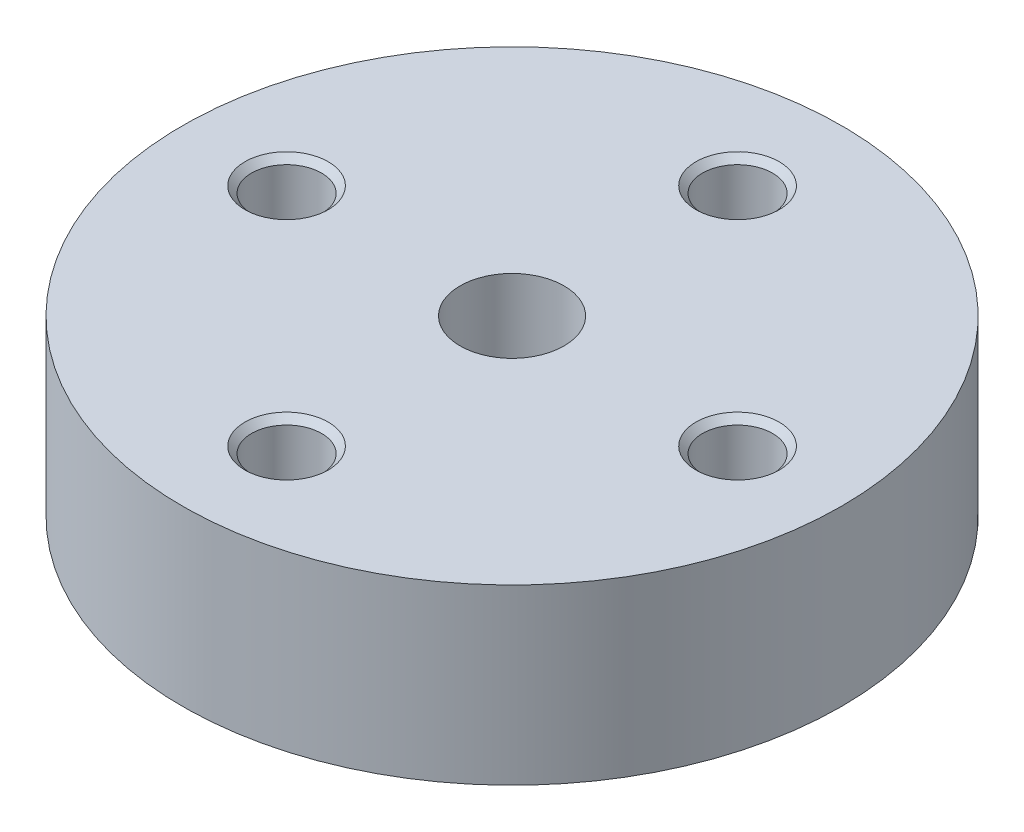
ISO-10303-21;
HEADER;
FILE_DESCRIPTION(('STEP AP214'),'2;1');
FILE_NAME('part.step','',(''),(''),'','','');
FILE_SCHEMA(('AUTOMOTIVE_DESIGN { 1 0 10303 214 1 1 1 1 }'));
ENDSEC;
DATA;
#1=APPLICATION_CONTEXT('core data for automotive mechanical design processes');
#2=APPLICATION_PROTOCOL_DEFINITION('international standard','automotive_design',2000,#1);
#3=PRODUCT_CONTEXT('',#1,'mechanical');
#4=PRODUCT('Part','Part','',(#3));
#5=PRODUCT_RELATED_PRODUCT_CATEGORY('part','',(#4));
#6=PRODUCT_DEFINITION_FORMATION('','',#4);
#7=PRODUCT_DEFINITION_CONTEXT('part definition',#1,'design');
#8=PRODUCT_DEFINITION('design','',#6,#7);
#9=PRODUCT_DEFINITION_SHAPE('','',#8);
#10=(LENGTH_UNIT() NAMED_UNIT(*) SI_UNIT(.MILLI.,.METRE.));
#11=(NAMED_UNIT(*) PLANE_ANGLE_UNIT() SI_UNIT($,.RADIAN.));
#12=(NAMED_UNIT(*) SI_UNIT($,.STERADIAN.) SOLID_ANGLE_UNIT());
#13=UNCERTAINTY_MEASURE_WITH_UNIT(LENGTH_MEASURE(1.E-05),#10,'distance_accuracy_value','');
#14=(GEOMETRIC_REPRESENTATION_CONTEXT(3) GLOBAL_UNCERTAINTY_ASSIGNED_CONTEXT((#13)) GLOBAL_UNIT_ASSIGNED_CONTEXT((#10,
#11,#12)) REPRESENTATION_CONTEXT('',''));
#15=CARTESIAN_POINT('',(0.,0.,0.));
#16=DIRECTION('',(0.,0.,1.));
#17=DIRECTION('',(1.,0.,0.));
#18=AXIS2_PLACEMENT_3D('',#15,#16,#17);
#19=CARTESIAN_POINT('',(0.,12.5,0.));
#20=DIRECTION('',(0.,-1.,0.));
#21=DIRECTION('',(1.,0.,0.));
#22=AXIS2_PLACEMENT_3D('',#19,#20,#21);
#23=CYLINDRICAL_SURFACE('',#22,47.5);
#24=CARTESIAN_POINT('',(0.,0.,0.));
#25=DIRECTION('',(0.,1.,0.));
#26=DIRECTION('',(1.,0.,0.));
#27=AXIS2_PLACEMENT_3D('',#24,#25,#26);
#28=CIRCLE('',#27,47.5);
#29=CARTESIAN_POINT('',(47.5,0.,0.));
#30=VERTEX_POINT('',#29);
#31=EDGE_CURVE('E9',#30,#30,#28,.T.);
#32=ORIENTED_EDGE('',*,*,#31,.T.);
#33=EDGE_LOOP('',(#32));
#34=FACE_BOUND('',#33,.T.);
#35=CARTESIAN_POINT('',(0.,25.,0.));
#36=DIRECTION('',(0.,1.,0.));
#37=DIRECTION('',(1.,0.,0.));
#38=AXIS2_PLACEMENT_3D('',#35,#36,#37);
#39=CIRCLE('',#38,47.5);
#40=CARTESIAN_POINT('',(47.5,25.,0.));
#41=VERTEX_POINT('',#40);
#42=EDGE_CURVE('E145',#41,#41,#39,.T.);
#43=ORIENTED_EDGE('',*,*,#42,.F.);
#44=EDGE_LOOP('',(#43));
#45=FACE_BOUND('',#44,.T.);
#46=ADVANCED_FACE('F15',(#34,#45),#23,.T.);
#47=CARTESIAN_POINT('',(27.5,0.,0.));
#48=DIRECTION('',(0.,-1.,0.));
#49=DIRECTION('',(-1.,0.,0.));
#50=AXIS2_PLACEMENT_3D('',#47,#48,#49);
#51=PLANE('',#50);
#52=CARTESIAN_POINT('',(0.,0.,0.));
#53=DIRECTION('',(0.,1.,0.));
#54=DIRECTION('',(1.,0.,0.));
#55=AXIS2_PLACEMENT_3D('',#52,#53,#54);
#56=CIRCLE('',#55,7.5);
#57=CARTESIAN_POINT('',(7.5,0.,0.));
#58=VERTEX_POINT('',#57);
#59=EDGE_CURVE('E22',#58,#58,#56,.T.);
#60=ORIENTED_EDGE('',*,*,#59,.T.);
#61=EDGE_LOOP('',(#60));
#62=FACE_BOUND('',#61,.T.);
#63=ORIENTED_EDGE('',*,*,#31,.F.);
#64=EDGE_LOOP('',(#63));
#65=FACE_BOUND('',#64,.T.);
#66=ADVANCED_FACE('F139',(#62,#65),#51,.T.);
#67=CARTESIAN_POINT('',(0.,12.5,0.));
#68=DIRECTION('',(0.,-1.,0.));
#69=DIRECTION('',(1.,0.,0.));
#70=AXIS2_PLACEMENT_3D('',#67,#68,#69);
#71=CYLINDRICAL_SURFACE('',#70,7.5);
#72=CARTESIAN_POINT('',(0.,25.,0.));
#73=DIRECTION('',(0.,1.,0.));
#74=DIRECTION('',(1.,0.,0.));
#75=AXIS2_PLACEMENT_3D('',#72,#73,#74);
#76=CIRCLE('',#75,7.5);
#77=CARTESIAN_POINT('',(7.5,25.,0.));
#78=VERTEX_POINT('',#77);
#79=EDGE_CURVE('E146',#78,#78,#76,.T.);
#80=ORIENTED_EDGE('',*,*,#79,.T.);
#81=EDGE_LOOP('',(#80));
#82=FACE_BOUND('',#81,.T.);
#83=ORIENTED_EDGE('',*,*,#59,.F.);
#84=EDGE_LOOP('',(#83));
#85=FACE_BOUND('',#84,.T.);
#86=ADVANCED_FACE('F134',(#82,#85),#71,.F.);
#87=CARTESIAN_POINT('',(27.5,25.,0.));
#88=DIRECTION('',(0.,1.,0.));
#89=DIRECTION('',(1.,0.,0.));
#90=AXIS2_PLACEMENT_3D('',#87,#88,#89);
#91=PLANE('',#90);
#92=ORIENTED_EDGE('',*,*,#42,.T.);
#93=EDGE_LOOP('',(#92));
#94=FACE_BOUND('',#93,.T.);
#95=ORIENTED_EDGE('',*,*,#79,.F.);
#96=EDGE_LOOP('',(#95));
#97=FACE_BOUND('',#96,.T.);
#98=CARTESIAN_POINT('',(32.5,25.,0.));
#99=DIRECTION('',(0.,-1.,0.));
#100=DIRECTION('',(1.,0.,0.));
#101=AXIS2_PLACEMENT_3D('',#98,#99,#100);
#102=CIRCLE('',#101,6.);
#103=CARTESIAN_POINT('',(38.5,25.,0.));
#104=VERTEX_POINT('',#103);
#105=EDGE_CURVE('E158',#104,#104,#102,.T.);
#106=ORIENTED_EDGE('',*,*,#105,.T.);
#107=EDGE_LOOP('',(#106));
#108=FACE_BOUND('',#107,.T.);
#109=CARTESIAN_POINT('',(0.,25.,-32.5));
#110=DIRECTION('',(0.,-1.,0.));
#111=DIRECTION('',(0.,0.,-1.));
#112=AXIS2_PLACEMENT_3D('',#109,#110,#111);
#113=CIRCLE('',#112,6.);
#114=CARTESIAN_POINT('',(0.,25.,-38.5));
#115=VERTEX_POINT('',#114);
#116=EDGE_CURVE('E168',#115,#115,#113,.T.);
#117=ORIENTED_EDGE('',*,*,#116,.T.);
#118=EDGE_LOOP('',(#117));
#119=FACE_BOUND('',#118,.T.);
#120=CARTESIAN_POINT('',(-32.5,25.,0.));
#121=DIRECTION('',(0.,-1.,0.));
#122=DIRECTION('',(-1.,0.,0.));
#123=AXIS2_PLACEMENT_3D('',#120,#121,#122);
#124=CIRCLE('',#123,6.);
#125=CARTESIAN_POINT('',(-38.5,25.,0.));
#126=VERTEX_POINT('',#125);
#127=EDGE_CURVE('E175',#126,#126,#124,.T.);
#128=ORIENTED_EDGE('',*,*,#127,.T.);
#129=EDGE_LOOP('',(#128));
#130=FACE_BOUND('',#129,.T.);
#131=CARTESIAN_POINT('',(0.,25.,32.5));
#132=DIRECTION('',(0.,-1.,0.));
#133=DIRECTION('',(0.,0.,1.));
#134=AXIS2_PLACEMENT_3D('',#131,#132,#133);
#135=CIRCLE('',#134,6.);
#136=CARTESIAN_POINT('',(0.,25.,38.5));
#137=VERTEX_POINT('',#136);
#138=EDGE_CURVE('E187',#137,#137,#135,.T.);
#139=ORIENTED_EDGE('',*,*,#138,.T.);
#140=EDGE_LOOP('',(#139));
#141=FACE_BOUND('',#140,.T.);
#142=ADVANCED_FACE('F123',(#94,#97,#108,#119,#130,#141),#91,.T.);
#143=CARTESIAN_POINT('',(32.5,5.54137867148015,0.));
#144=DIRECTION('',(0.,1.,0.));
#145=DIRECTION('',(1.,0.,0.));
#146=AXIS2_PLACEMENT_3D('',#143,#144,#145);
#147=CONICAL_SURFACE('',#146,2.52640625,1.0471975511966);
#148=CARTESIAN_POINT('',(32.5,7.,0.));
#149=DIRECTION('',(0.,-1.,0.));
#150=DIRECTION('',(1.,0.,0.));
#151=AXIS2_PLACEMENT_3D('',#148,#149,#150);
#152=CIRCLE('',#151,5.0528125);
#153=CARTESIAN_POINT('',(37.5528125,7.,0.));
#154=VERTEX_POINT('',#153);
#155=EDGE_CURVE('E148',#154,#154,#152,.T.);
#156=ORIENTED_EDGE('',*,*,#155,.F.);
#157=EDGE_LOOP('',(#156));
#158=FACE_BOUND('',#157,.T.);
#159=CARTESIAN_POINT('',(32.5,4.08275734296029,0.));
#160=VERTEX_POINT('',#159);
#161=VERTEX_LOOP('',#160);
#162=FACE_BOUND('',#161,.T.);
#163=ADVANCED_FACE('F120',(#158,#162),#147,.F.);
#164=CARTESIAN_POINT('',(32.5,9.52640625,0.));
#165=DIRECTION('',(0.,1.,0.));
#166=DIRECTION('',(1.,0.,0.));
#167=AXIS2_PLACEMENT_3D('',#164,#165,#166);
#168=CYLINDRICAL_SURFACE('',#167,5.0528125);
#169=CARTESIAN_POINT('',(32.5,12.0528125,0.));
#170=DIRECTION('',(0.,-1.,0.));
#171=DIRECTION('',(1.,0.,0.));
#172=AXIS2_PLACEMENT_3D('',#169,#170,#171);
#173=CIRCLE('',#172,5.0528125);
#174=CARTESIAN_POINT('',(37.5528125,12.0528125,0.));
#175=VERTEX_POINT('',#174);
#176=EDGE_CURVE('E152',#175,#175,#173,.T.);
#177=ORIENTED_EDGE('',*,*,#176,.F.);
#178=EDGE_LOOP('',(#177));
#179=FACE_BOUND('',#178,.T.);
#180=ORIENTED_EDGE('',*,*,#155,.T.);
#181=EDGE_LOOP('',(#180));
#182=FACE_BOUND('',#181,.T.);
#183=ADVANCED_FACE('F122',(#179,#182),#168,.F.);
#184=CARTESIAN_POINT('',(32.5,12.52640625,0.));
#185=DIRECTION('',(0.,1.,0.));
#186=DIRECTION('',(1.,0.,0.));
#187=AXIS2_PLACEMENT_3D('',#184,#185,#186);
#188=CONICAL_SURFACE('',#187,5.52640625,0.785398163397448);
#189=CARTESIAN_POINT('',(32.5,13.,0.));
#190=DIRECTION('',(0.,-1.,0.));
#191=DIRECTION('',(1.,0.,0.));
#192=AXIS2_PLACEMENT_3D('',#189,#190,#191);
#193=CIRCLE('',#192,6.);
#194=CARTESIAN_POINT('',(38.5,13.,0.));
#195=VERTEX_POINT('',#194);
#196=EDGE_CURVE('E154',#195,#195,#193,.T.);
#197=ORIENTED_EDGE('',*,*,#196,.F.);
#198=EDGE_LOOP('',(#197));
#199=FACE_BOUND('',#198,.T.);
#200=ORIENTED_EDGE('',*,*,#176,.T.);
#201=EDGE_LOOP('',(#200));
#202=FACE_BOUND('',#201,.T.);
#203=ADVANCED_FACE('F131',(#199,#202),#188,.F.);
#204=CARTESIAN_POINT('',(38.02640625,13.,0.));
#205=DIRECTION('',(0.,1.,0.));
#206=DIRECTION('',(-1.,0.,0.));
#207=AXIS2_PLACEMENT_3D('',#204,#205,#206);
#208=PLANE('',#207);
#209=CARTESIAN_POINT('',(32.5,13.,0.));
#210=DIRECTION('',(0.,-1.,0.));
#211=DIRECTION('',(1.,0.,0.));
#212=AXIS2_PLACEMENT_3D('',#209,#210,#211);
#213=CIRCLE('',#212,5.0528125);
#214=CARTESIAN_POINT('',(37.5528125,13.,0.));
#215=VERTEX_POINT('',#214);
#216=EDGE_CURVE('E156',#215,#215,#213,.T.);
#217=ORIENTED_EDGE('',*,*,#216,.F.);
#218=EDGE_LOOP('',(#217));
#219=FACE_BOUND('',#218,.T.);
#220=ORIENTED_EDGE('',*,*,#196,.T.);
#221=EDGE_LOOP('',(#220));
#222=FACE_BOUND('',#221,.T.);
#223=ADVANCED_FACE('F281',(#219,#222),#208,.F.);
#224=CARTESIAN_POINT('',(32.5,18.52640625,0.));
#225=DIRECTION('',(0.,1.,0.));
#226=DIRECTION('',(1.,0.,0.));
#227=AXIS2_PLACEMENT_3D('',#224,#225,#226);
#228=CYLINDRICAL_SURFACE('',#227,5.0528125);
#229=CARTESIAN_POINT('',(32.5,24.0528125,0.));
#230=DIRECTION('',(0.,-1.,0.));
#231=DIRECTION('',(1.,0.,0.));
#232=AXIS2_PLACEMENT_3D('',#229,#230,#231);
#233=CIRCLE('',#232,5.0528125);
#234=CARTESIAN_POINT('',(37.5528125,24.0528125,0.));
#235=VERTEX_POINT('',#234);
#236=EDGE_CURVE('E159',#235,#235,#233,.T.);
#237=ORIENTED_EDGE('',*,*,#236,.F.);
#238=EDGE_LOOP('',(#237));
#239=FACE_BOUND('',#238,.T.);
#240=ORIENTED_EDGE('',*,*,#216,.T.);
#241=EDGE_LOOP('',(#240));
#242=FACE_BOUND('',#241,.T.);
#243=ADVANCED_FACE('F277',(#239,#242),#228,.F.);
#244=CARTESIAN_POINT('',(32.5,24.52640625,0.));
#245=DIRECTION('',(0.,1.,0.));
#246=DIRECTION('',(1.,0.,0.));
#247=AXIS2_PLACEMENT_3D('',#244,#245,#246);
#248=CONICAL_SURFACE('',#247,5.52640625,0.785398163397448);
#249=ORIENTED_EDGE('',*,*,#105,.F.);
#250=EDGE_LOOP('',(#249));
#251=FACE_BOUND('',#250,.T.);
#252=ORIENTED_EDGE('',*,*,#236,.T.);
#253=EDGE_LOOP('',(#252));
#254=FACE_BOUND('',#253,.T.);
#255=ADVANCED_FACE('F273',(#251,#254),#248,.F.);
#256=CARTESIAN_POINT('',(0.,5.54137867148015,-32.5));
#257=DIRECTION('',(0.,1.,0.));
#258=DIRECTION('',(0.,0.,-1.));
#259=AXIS2_PLACEMENT_3D('',#256,#257,#258);
#260=CONICAL_SURFACE('',#259,2.52640625,1.0471975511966);
#261=CARTESIAN_POINT('',(0.,7.,-32.5));
#262=DIRECTION('',(0.,-1.,0.));
#263=DIRECTION('',(0.,0.,-1.));
#264=AXIS2_PLACEMENT_3D('',#261,#262,#263);
#265=CIRCLE('',#264,5.0528125);
#266=CARTESIAN_POINT('',(0.,7.,-37.5528125));
#267=VERTEX_POINT('',#266);
#268=EDGE_CURVE('E161',#267,#267,#265,.T.);
#269=ORIENTED_EDGE('',*,*,#268,.F.);
#270=EDGE_LOOP('',(#269));
#271=FACE_BOUND('',#270,.T.);
#272=CARTESIAN_POINT('',(0.,4.08275734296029,-32.5));
#273=VERTEX_POINT('',#272);
#274=VERTEX_LOOP('',#273);
#275=FACE_BOUND('',#274,.T.);
#276=ADVANCED_FACE('F269',(#271,#275),#260,.F.);
#277=CARTESIAN_POINT('',(0.,9.52640625,-32.5));
#278=DIRECTION('',(0.,1.,0.));
#279=DIRECTION('',(0.,0.,-1.));
#280=AXIS2_PLACEMENT_3D('',#277,#278,#279);
#281=CYLINDRICAL_SURFACE('',#280,5.0528125);
#282=CARTESIAN_POINT('',(0.,12.0528125,-32.5));
#283=DIRECTION('',(0.,-1.,0.));
#284=DIRECTION('',(0.,0.,-1.));
#285=AXIS2_PLACEMENT_3D('',#282,#283,#284);
#286=CIRCLE('',#285,5.0528125);
#287=CARTESIAN_POINT('',(0.,12.0528125,-37.5528125));
#288=VERTEX_POINT('',#287);
#289=EDGE_CURVE('E163',#288,#288,#286,.T.);
#290=ORIENTED_EDGE('',*,*,#289,.F.);
#291=EDGE_LOOP('',(#290));
#292=FACE_BOUND('',#291,.T.);
#293=ORIENTED_EDGE('',*,*,#268,.T.);
#294=EDGE_LOOP('',(#293));
#295=FACE_BOUND('',#294,.T.);
#296=ADVANCED_FACE('F266',(#292,#295),#281,.F.);
#297=CARTESIAN_POINT('',(0.,12.52640625,-32.5));
#298=DIRECTION('',(0.,1.,0.));
#299=DIRECTION('',(0.,0.,-1.));
#300=AXIS2_PLACEMENT_3D('',#297,#298,#299);
#301=CONICAL_SURFACE('',#300,5.52640625,0.785398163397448);
#302=CARTESIAN_POINT('',(0.,13.,-32.5));
#303=DIRECTION('',(0.,-1.,0.));
#304=DIRECTION('',(0.,0.,-1.));
#305=AXIS2_PLACEMENT_3D('',#302,#303,#304);
#306=CIRCLE('',#305,6.);
#307=CARTESIAN_POINT('',(0.,13.,-38.5));
#308=VERTEX_POINT('',#307);
#309=EDGE_CURVE('E165',#308,#308,#306,.T.);
#310=ORIENTED_EDGE('',*,*,#309,.F.);
#311=EDGE_LOOP('',(#310));
#312=FACE_BOUND('',#311,.T.);
#313=ORIENTED_EDGE('',*,*,#289,.T.);
#314=EDGE_LOOP('',(#313));
#315=FACE_BOUND('',#314,.T.);
#316=ADVANCED_FACE('F258',(#312,#315),#301,.F.);
#317=CARTESIAN_POINT('',(0.,13.,-38.02640625));
#318=DIRECTION('',(0.,1.,0.));
#319=DIRECTION('',(0.,0.,1.));
#320=AXIS2_PLACEMENT_3D('',#317,#318,#319);
#321=PLANE('',#320);
#322=CARTESIAN_POINT('',(0.,13.,-32.5));
#323=DIRECTION('',(0.,-1.,0.));
#324=DIRECTION('',(0.,0.,-1.));
#325=AXIS2_PLACEMENT_3D('',#322,#323,#324);
#326=CIRCLE('',#325,5.0528125);
#327=CARTESIAN_POINT('',(0.,13.,-37.5528125));
#328=VERTEX_POINT('',#327);
#329=EDGE_CURVE('E166',#328,#328,#326,.T.);
#330=ORIENTED_EDGE('',*,*,#329,.F.);
#331=EDGE_LOOP('',(#330));
#332=FACE_BOUND('',#331,.T.);
#333=ORIENTED_EDGE('',*,*,#309,.T.);
#334=EDGE_LOOP('',(#333));
#335=FACE_BOUND('',#334,.T.);
#336=ADVANCED_FACE('F255',(#332,#335),#321,.F.);
#337=CARTESIAN_POINT('',(0.,18.52640625,-32.5));
#338=DIRECTION('',(0.,1.,0.));
#339=DIRECTION('',(0.,0.,-1.));
#340=AXIS2_PLACEMENT_3D('',#337,#338,#339);
#341=CYLINDRICAL_SURFACE('',#340,5.0528125);
#342=CARTESIAN_POINT('',(0.,24.0528125,-32.5));
#343=DIRECTION('',(0.,-1.,0.));
#344=DIRECTION('',(0.,0.,-1.));
#345=AXIS2_PLACEMENT_3D('',#342,#343,#344);
#346=CIRCLE('',#345,5.0528125);
#347=CARTESIAN_POINT('',(0.,24.0528125,-37.5528125));
#348=VERTEX_POINT('',#347);
#349=EDGE_CURVE('E177',#348,#348,#346,.T.);
#350=ORIENTED_EDGE('',*,*,#349,.F.);
#351=EDGE_LOOP('',(#350));
#352=FACE_BOUND('',#351,.T.);
#353=ORIENTED_EDGE('',*,*,#329,.T.);
#354=EDGE_LOOP('',(#353));
#355=FACE_BOUND('',#354,.T.);
#356=ADVANCED_FACE('F240',(#352,#355),#341,.F.);
#357=CARTESIAN_POINT('',(0.,24.52640625,-32.5));
#358=DIRECTION('',(0.,1.,0.));
#359=DIRECTION('',(0.,0.,-1.));
#360=AXIS2_PLACEMENT_3D('',#357,#358,#359);
#361=CONICAL_SURFACE('',#360,5.52640625,0.785398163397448);
#362=ORIENTED_EDGE('',*,*,#116,.F.);
#363=EDGE_LOOP('',(#362));
#364=FACE_BOUND('',#363,.T.);
#365=ORIENTED_EDGE('',*,*,#349,.T.);
#366=EDGE_LOOP('',(#365));
#367=FACE_BOUND('',#366,.T.);
#368=ADVANCED_FACE('F235',(#364,#367),#361,.F.);
#369=CARTESIAN_POINT('',(-32.5,5.54137867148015,0.));
#370=DIRECTION('',(0.,1.,0.));
#371=DIRECTION('',(-1.,0.,0.));
#372=AXIS2_PLACEMENT_3D('',#369,#370,#371);
#373=CONICAL_SURFACE('',#372,2.52640625,1.0471975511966);
#374=CARTESIAN_POINT('',(-32.5,7.,0.));
#375=DIRECTION('',(0.,-1.,0.));
#376=DIRECTION('',(-1.,0.,0.));
#377=AXIS2_PLACEMENT_3D('',#374,#375,#376);
#378=CIRCLE('',#377,5.0528125);
#379=CARTESIAN_POINT('',(-37.5528125,7.,0.));
#380=VERTEX_POINT('',#379);
#381=EDGE_CURVE('E171',#380,#380,#378,.T.);
#382=ORIENTED_EDGE('',*,*,#381,.F.);
#383=EDGE_LOOP('',(#382));
#384=FACE_BOUND('',#383,.T.);
#385=CARTESIAN_POINT('',(-32.5,4.08275734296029,0.));
#386=VERTEX_POINT('',#385);
#387=VERTEX_LOOP('',#386);
#388=FACE_BOUND('',#387,.T.);
#389=ADVANCED_FACE('F229',(#384,#388),#373,.F.);
#390=CARTESIAN_POINT('',(-32.5,9.52640625,0.));
#391=DIRECTION('',(0.,1.,0.));
#392=DIRECTION('',(-1.,0.,0.));
#393=AXIS2_PLACEMENT_3D('',#390,#391,#392);
#394=CYLINDRICAL_SURFACE('',#393,5.0528125);
#395=CARTESIAN_POINT('',(-32.5,12.0528125,0.));
#396=DIRECTION('',(0.,-1.,0.));
#397=DIRECTION('',(-1.,0.,0.));
#398=AXIS2_PLACEMENT_3D('',#395,#396,#397);
#399=CIRCLE('',#398,5.0528125);
#400=CARTESIAN_POINT('',(-37.5528125,12.0528125,0.));
#401=VERTEX_POINT('',#400);
#402=EDGE_CURVE('E169',#401,#401,#399,.T.);
#403=ORIENTED_EDGE('',*,*,#402,.F.);
#404=EDGE_LOOP('',(#403));
#405=FACE_BOUND('',#404,.T.);
#406=ORIENTED_EDGE('',*,*,#381,.T.);
#407=EDGE_LOOP('',(#406));
#408=FACE_BOUND('',#407,.T.);
#409=ADVANCED_FACE('F223',(#405,#408),#394,.F.);
#410=CARTESIAN_POINT('',(-32.5,12.52640625,0.));
#411=DIRECTION('',(0.,1.,0.));
#412=DIRECTION('',(-1.,0.,0.));
#413=AXIS2_PLACEMENT_3D('',#410,#411,#412);
#414=CONICAL_SURFACE('',#413,5.52640625,0.785398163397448);
#415=CARTESIAN_POINT('',(-32.5,13.,0.));
#416=DIRECTION('',(0.,-1.,0.));
#417=DIRECTION('',(-1.,0.,0.));
#418=AXIS2_PLACEMENT_3D('',#415,#416,#417);
#419=CIRCLE('',#418,6.);
#420=CARTESIAN_POINT('',(-38.5,13.,0.));
#421=VERTEX_POINT('',#420);
#422=EDGE_CURVE('E172',#421,#421,#419,.T.);
#423=ORIENTED_EDGE('',*,*,#422,.F.);
#424=EDGE_LOOP('',(#423));
#425=FACE_BOUND('',#424,.T.);
#426=ORIENTED_EDGE('',*,*,#402,.T.);
#427=EDGE_LOOP('',(#426));
#428=FACE_BOUND('',#427,.T.);
#429=ADVANCED_FACE('F217',(#425,#428),#414,.F.);
#430=CARTESIAN_POINT('',(-38.02640625,13.,0.));
#431=DIRECTION('',(0.,1.,0.));
#432=DIRECTION('',(1.,0.,0.));
#433=AXIS2_PLACEMENT_3D('',#430,#431,#432);
#434=PLANE('',#433);
#435=CARTESIAN_POINT('',(-32.5,13.,0.));
#436=DIRECTION('',(0.,-1.,0.));
#437=DIRECTION('',(-1.,0.,0.));
#438=AXIS2_PLACEMENT_3D('',#435,#436,#437);
#439=CIRCLE('',#438,5.0528125);
#440=CARTESIAN_POINT('',(-37.5528125,13.,0.));
#441=VERTEX_POINT('',#440);
#442=EDGE_CURVE('E174',#441,#441,#439,.T.);
#443=ORIENTED_EDGE('',*,*,#442,.F.);
#444=EDGE_LOOP('',(#443));
#445=FACE_BOUND('',#444,.T.);
#446=ORIENTED_EDGE('',*,*,#422,.T.);
#447=EDGE_LOOP('',(#446));
#448=FACE_BOUND('',#447,.T.);
#449=ADVANCED_FACE('F211',(#445,#448),#434,.F.);
#450=CARTESIAN_POINT('',(-32.5,18.52640625,0.));
#451=DIRECTION('',(0.,1.,0.));
#452=DIRECTION('',(-1.,0.,0.));
#453=AXIS2_PLACEMENT_3D('',#450,#451,#452);
#454=CYLINDRICAL_SURFACE('',#453,5.0528125);
#455=CARTESIAN_POINT('',(-32.5,24.0528125,0.));
#456=DIRECTION('',(0.,-1.,0.));
#457=DIRECTION('',(-1.,0.,0.));
#458=AXIS2_PLACEMENT_3D('',#455,#456,#457);
#459=CIRCLE('',#458,5.0528125);
#460=CARTESIAN_POINT('',(-37.5528125,24.0528125,0.));
#461=VERTEX_POINT('',#460);
#462=EDGE_CURVE('E189',#461,#461,#459,.T.);
#463=ORIENTED_EDGE('',*,*,#462,.F.);
#464=EDGE_LOOP('',(#463));
#465=FACE_BOUND('',#464,.T.);
#466=ORIENTED_EDGE('',*,*,#442,.T.);
#467=EDGE_LOOP('',(#466));
#468=FACE_BOUND('',#467,.T.);
#469=ADVANCED_FACE('F205',(#465,#468),#454,.F.);
#470=CARTESIAN_POINT('',(-32.5,24.52640625,0.));
#471=DIRECTION('',(0.,1.,0.));
#472=DIRECTION('',(-1.,0.,0.));
#473=AXIS2_PLACEMENT_3D('',#470,#471,#472);
#474=CONICAL_SURFACE('',#473,5.52640625,0.785398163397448);
#475=ORIENTED_EDGE('',*,*,#127,.F.);
#476=EDGE_LOOP('',(#475));
#477=FACE_BOUND('',#476,.T.);
#478=ORIENTED_EDGE('',*,*,#462,.T.);
#479=EDGE_LOOP('',(#478));
#480=FACE_BOUND('',#479,.T.);
#481=ADVANCED_FACE('F201',(#477,#480),#474,.F.);
#482=CARTESIAN_POINT('',(0.,5.54137867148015,32.5));
#483=DIRECTION('',(0.,1.,0.));
#484=DIRECTION('',(0.,0.,1.));
#485=AXIS2_PLACEMENT_3D('',#482,#483,#484);
#486=CONICAL_SURFACE('',#485,2.52640625,1.0471975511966);
#487=CARTESIAN_POINT('',(0.,7.,32.5));
#488=DIRECTION('',(0.,-1.,0.));
#489=DIRECTION('',(0.,0.,1.));
#490=AXIS2_PLACEMENT_3D('',#487,#488,#489);
#491=CIRCLE('',#490,5.0528125);
#492=CARTESIAN_POINT('',(0.,7.,37.5528125));
#493=VERTEX_POINT('',#492);
#494=EDGE_CURVE('E181',#493,#493,#491,.T.);
#495=ORIENTED_EDGE('',*,*,#494,.F.);
#496=EDGE_LOOP('',(#495));
#497=FACE_BOUND('',#496,.T.);
#498=CARTESIAN_POINT('',(0.,4.08275734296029,32.5));
#499=VERTEX_POINT('',#498);
#500=VERTEX_LOOP('',#499);
#501=FACE_BOUND('',#500,.T.);
#502=ADVANCED_FACE('F204',(#497,#501),#486,.F.);
#503=CARTESIAN_POINT('',(0.,9.52640625,32.5));
#504=DIRECTION('',(0.,1.,0.));
#505=DIRECTION('',(0.,0.,1.));
#506=AXIS2_PLACEMENT_3D('',#503,#504,#505);
#507=CYLINDRICAL_SURFACE('',#506,5.0528125);
#508=CARTESIAN_POINT('',(0.,12.0528125,32.5));
#509=DIRECTION('',(0.,-1.,0.));
#510=DIRECTION('',(0.,0.,1.));
#511=AXIS2_PLACEMENT_3D('',#508,#509,#510);
#512=CIRCLE('',#511,5.0528125);
#513=CARTESIAN_POINT('',(0.,12.0528125,37.5528125));
#514=VERTEX_POINT('',#513);
#515=EDGE_CURVE('E179',#514,#514,#512,.T.);
#516=ORIENTED_EDGE('',*,*,#515,.F.);
#517=EDGE_LOOP('',(#516));
#518=FACE_BOUND('',#517,.T.);
#519=ORIENTED_EDGE('',*,*,#494,.T.);
#520=EDGE_LOOP('',(#519));
#521=FACE_BOUND('',#520,.T.);
#522=ADVANCED_FACE('F253',(#518,#521),#507,.F.);
#523=CARTESIAN_POINT('',(0.,12.52640625,32.5));
#524=DIRECTION('',(0.,1.,0.));
#525=DIRECTION('',(0.,0.,1.));
#526=AXIS2_PLACEMENT_3D('',#523,#524,#525);
#527=CONICAL_SURFACE('',#526,5.52640625,0.785398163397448);
#528=CARTESIAN_POINT('',(0.,13.,32.5));
#529=DIRECTION('',(0.,-1.,0.));
#530=DIRECTION('',(0.,0.,1.));
#531=AXIS2_PLACEMENT_3D('',#528,#529,#530);
#532=CIRCLE('',#531,6.);
#533=CARTESIAN_POINT('',(0.,13.,38.5));
#534=VERTEX_POINT('',#533);
#535=EDGE_CURVE('E182',#534,#534,#532,.T.);
#536=ORIENTED_EDGE('',*,*,#535,.F.);
#537=EDGE_LOOP('',(#536));
#538=FACE_BOUND('',#537,.T.);
#539=ORIENTED_EDGE('',*,*,#515,.T.);
#540=EDGE_LOOP('',(#539));
#541=FACE_BOUND('',#540,.T.);
#542=ADVANCED_FACE('F249',(#538,#541),#527,.F.);
#543=CARTESIAN_POINT('',(0.,13.,38.02640625));
#544=DIRECTION('',(0.,1.,0.));
#545=DIRECTION('',(0.,0.,-1.));
#546=AXIS2_PLACEMENT_3D('',#543,#544,#545);
#547=PLANE('',#546);
#548=CARTESIAN_POINT('',(0.,13.,32.5));
#549=DIRECTION('',(0.,-1.,0.));
#550=DIRECTION('',(0.,0.,1.));
#551=AXIS2_PLACEMENT_3D('',#548,#549,#550);
#552=CIRCLE('',#551,5.0528125);
#553=CARTESIAN_POINT('',(0.,13.,37.5528125));
#554=VERTEX_POINT('',#553);
#555=EDGE_CURVE('E185',#554,#554,#552,.T.);
#556=ORIENTED_EDGE('',*,*,#555,.F.);
#557=EDGE_LOOP('',(#556));
#558=FACE_BOUND('',#557,.T.);
#559=ORIENTED_EDGE('',*,*,#535,.T.);
#560=EDGE_LOOP('',(#559));
#561=FACE_BOUND('',#560,.T.);
#562=ADVANCED_FACE('F246',(#558,#561),#547,.F.);
#563=CARTESIAN_POINT('',(0.,18.52640625,32.5));
#564=DIRECTION('',(0.,1.,0.));
#565=DIRECTION('',(0.,0.,1.));
#566=AXIS2_PLACEMENT_3D('',#563,#564,#565);
#567=CYLINDRICAL_SURFACE('',#566,5.0528125);
#568=CARTESIAN_POINT('',(0.,24.0528125,32.5));
#569=DIRECTION('',(0.,-1.,0.));
#570=DIRECTION('',(0.,0.,1.));
#571=AXIS2_PLACEMENT_3D('',#568,#569,#570);
#572=CIRCLE('',#571,5.0528125);
#573=CARTESIAN_POINT('',(0.,24.0528125,37.5528125));
#574=VERTEX_POINT('',#573);
#575=EDGE_CURVE('E194',#574,#574,#572,.T.);
#576=ORIENTED_EDGE('',*,*,#575,.F.);
#577=EDGE_LOOP('',(#576));
#578=FACE_BOUND('',#577,.T.);
#579=ORIENTED_EDGE('',*,*,#555,.T.);
#580=EDGE_LOOP('',(#579));
#581=FACE_BOUND('',#580,.T.);
#582=ADVANCED_FACE('F245',(#578,#581),#567,.F.);
#583=CARTESIAN_POINT('',(0.,24.52640625,32.5));
#584=DIRECTION('',(0.,1.,0.));
#585=DIRECTION('',(0.,0.,1.));
#586=AXIS2_PLACEMENT_3D('',#583,#584,#585);
#587=CONICAL_SURFACE('',#586,5.52640625,0.785398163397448);
#588=ORIENTED_EDGE('',*,*,#138,.F.);
#589=EDGE_LOOP('',(#588));
#590=FACE_BOUND('',#589,.T.);
#591=ORIENTED_EDGE('',*,*,#575,.T.);
#592=EDGE_LOOP('',(#591));
#593=FACE_BOUND('',#592,.T.);
#594=ADVANCED_FACE('F411',(#590,#593),#587,.F.);
#595=CLOSED_SHELL('',(#46,#66,#86,#142,#163,#183,#203,#223,#243,#255,#276,#296,#316,#336,#356,
#368,#389,#409,#429,#449,#469,#481,#502,#522,#542,#562,#582,#594));
#596=MANIFOLD_SOLID_BREP('B1',#595);
#597=ADVANCED_BREP_SHAPE_REPRESENTATION('',(#18,#596),#14);
#598=SHAPE_DEFINITION_REPRESENTATION(#9,#597);
ENDSEC;
END-ISO-10303-21;
